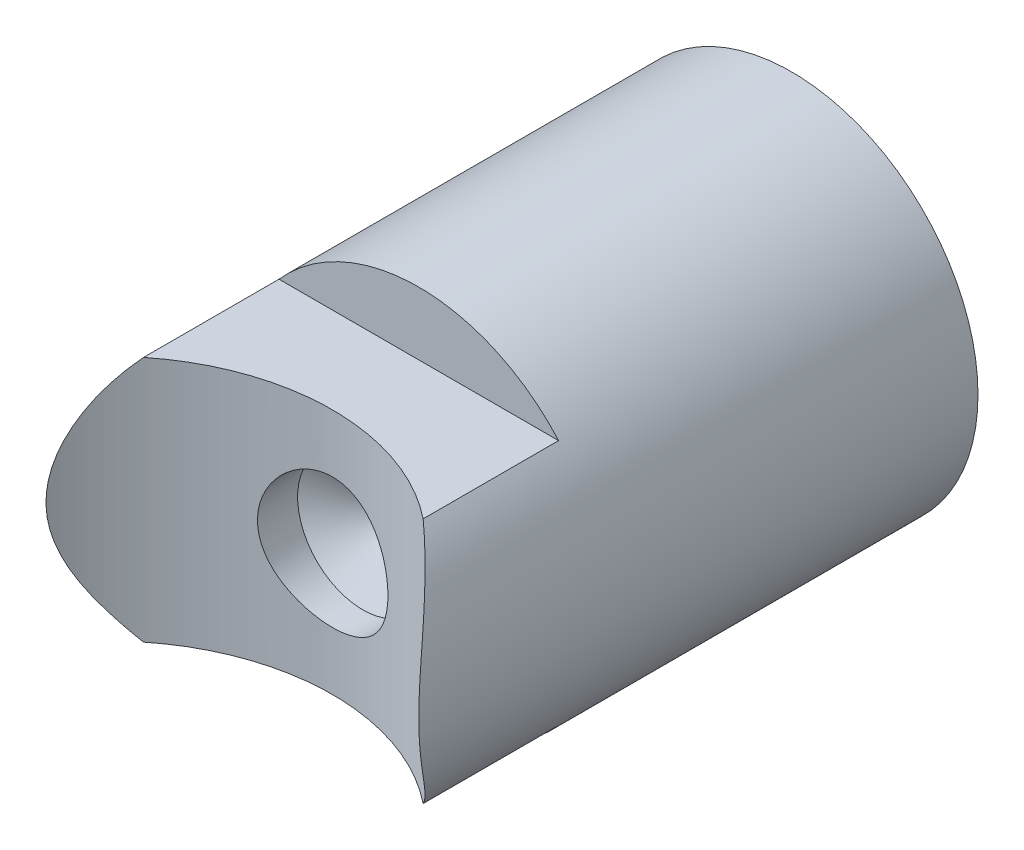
from build123d import *

# Parameters (mm, degrees)
ESQUISSE1_R                  = 10
EXTRUSION1_DEPTH             = 30
D_GAGEMENT_00004_D           = 7.0000114
D_GAGEMENT_00004_DEPTH       = 7
D_GAGEMENT_00004_TIP         = 2.103015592
ENL_V_MAT_EXTRU_3_DEPTH      = 17
ENL_V_MAT_EXTRU_3_DEPTH_BACK = 17
ENL_V_MAT_EXTRU_4_DEPTH      = 10


with BuildPart() as part:
    # Esquisse1 → Extrusion1 (new body)
    with BuildSketch(Plane.XY):
        Circle(ESQUISSE1_R)
    extrude(amount=-EXTRUSION1_DEPTH)

    # D_gagement _00004
    with Locations(Plane.XY):
        with Locations((0, 0)):
            Hole(D_GAGEMENT_00004_D / 2, depth=D_GAGEMENT_00004_DEPTH)
            with Locations((0, 0, -(D_GAGEMENT_00004_DEPTH + D_GAGEMENT_00004_TIP / 2))):  # 118° drill point
                Cone(0, D_GAGEMENT_00004_D / 2, D_GAGEMENT_00004_TIP, mode=Mode.SUBTRACT)

    # Esquisse2 → Enl_v. mat.-Extru.3 (cut, two sides: drawn at the far end of the back side and taken through both)
    with BuildSketch(Plane(origin=(0, 0, 0), x_dir=(1, 0, 0), z_dir=(0, 1, 0)).offset(-ENL_V_MAT_EXTRU_3_DEPTH_BACK)):
        with BuildLine():
            Line((-10, 0), (10, 0))
            ThreePointArc((10, 0), (0, 5.366750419), (-10, 0))
        make_face()
    extrude(amount=ENL_V_MAT_EXTRU_3_DEPTH + ENL_V_MAT_EXTRU_3_DEPTH_BACK, mode=Mode.SUBTRACT)

    # Esquisse17 → Enl_v. mat.-Extru.4 (cut)
    with BuildSketch(Plane.XY):
        with BuildLine():
            Line((-7.5, 6.614378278), (7.5, 6.614378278))
            ThreePointArc((7.5, 6.614378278), (0, 10), (-7.5, 6.614378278))
        make_face()
        with BuildLine():
            Line((7.5, -6.614378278), (-7.5, -6.614378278))
            ThreePointArc((-7.5, -6.614378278), (0, -10), (7.5, -6.614378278))
        make_face()
    extrude(amount=-ENL_V_MAT_EXTRU_4_DEPTH, mode=Mode.SUBTRACT)


solid = part.part
